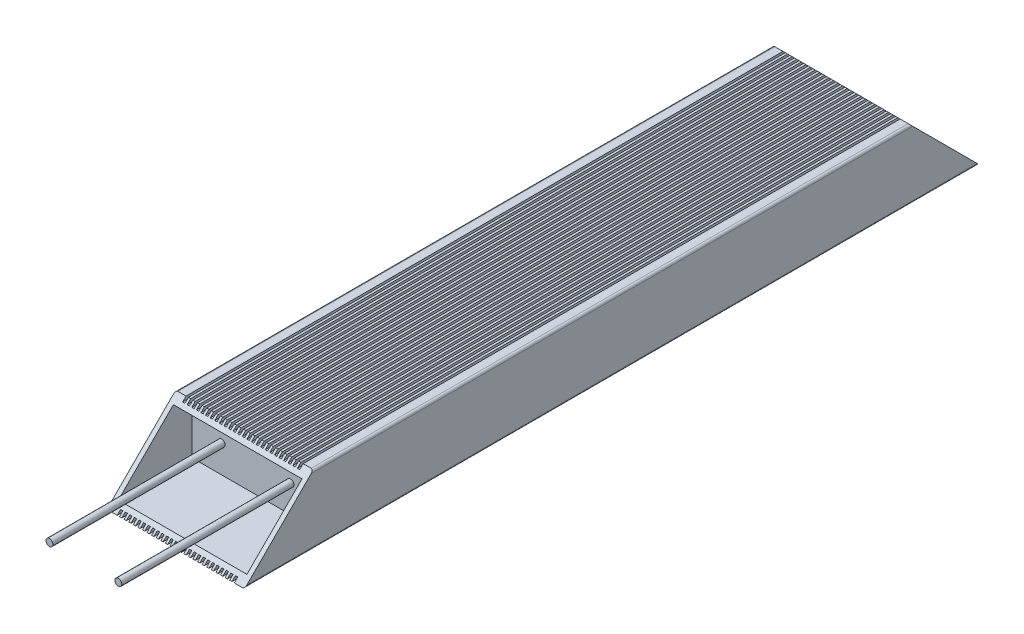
from build123d import *

# Parameters (mm, degrees)
BOSS_EXTRUDE1_DEPTH      = 160
BOSS_EXTRUDE1_DEPTH_BACK = 160
SKETCH1_W                = 56
SKETCH1_H                = 24
CUT_EXTRUDE1_DEPTH       = 172.537167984
CUT_EXTRUDE1_DEPTH_BACK  = 172.537167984
SKETCH1_3_W              = 56
SKETCH1_3_H              = 24
BOSS_EXTRUDE2_DEPTH      = 125
FILLET1_R                = 1
SKETCH4_R                = 1.5
BOSS_EXTRUDE3_DEPTH      = 75


with BuildPart() as part:
    # Sketch1 → Boss-Extrude1 (new, two sides: drawn at the far end of the back side and taken through both)
    with BuildSketch(Plane.XY.offset(-BOSS_EXTRUDE1_DEPTH_BACK)):
        Polygon((-30, 15), (-30, -15), (-25.5, -15), (-25.5, -13.5), (-24.5, -13.5), (-24.5, -15), (-23.5, -15), (-23.5, -13.5), (-22.5, -13.5), (-22.5, -15), (-21.5, -15), (-21.5, -13.5), (-20.5, -13.5), (-20.5, -15), (-19.5, -15), (-19.5, -13.5), (-18.5, -13.5), (-18.5, -15), (-17.5, -15), (-17.5, -13.5), (-16.5, -13.5), (-16.5, -15), (-15.5, -15), (-15.5, -13.5), (-14.5, -13.5), (-14.5, -15), (-13.5, -15), (-13.5, -13.5), (-12.5, -13.5), (-12.5, -15), (-11.5, -15), (-11.5, -13.5), (-10.5, -13.5), (-10.5, -15), (-9.5, -15), (-9.5, -13.5), (-8.5, -13.5), (-8.5, -15), (-7.5, -15), (-7.5, -13.5), (-6.5, -13.5), (-6.5, -15), (-5.5, -15), (-5.5, -13.5), (-4.5, -13.5), (-4.5, -15), (-3.5, -15), (-3.5, -13.5), (-2.5, -13.5), (-2.5, -15), (-1.5, -15), (-1.5, -13.5), (-0.5, -13.5), (-0.5, -15), (0.5, -15), (0.5, -13.5), (1.5, -13.5), (1.5, -15), (2.5, -15), (2.5, -13.5), (3.5, -13.5), (3.5, -15), (4.5, -15), (4.5, -13.5), (5.5, -13.5), (5.5, -15), (6.5, -15), (6.5, -13.5), (7.5, -13.5), (7.5, -15), (8.5, -15), (8.5, -13.5), (9.5, -13.5), (9.5, -15), (10.5, -15), (10.5, -13.5), (11.5, -13.5), (11.5, -15), (12.5, -15), (12.5, -13.5), (13.5, -13.5), (13.5, -15), (14.5, -15), (14.5, -13.5), (15.5, -13.5), (15.5, -15), (16.5, -15), (16.5, -13.5), (17.5, -13.5), (17.5, -15), (18.5, -15), (18.5, -13.5), (19.5, -13.5), (19.5, -15), (20.5, -15), (20.5, -13.5), (21.5, -13.5), (21.5, -15), (22.5, -15), (22.5, -13.5), (23.5, -13.5), (23.5, -15), (24.5, -15), (24.5, -13.5), (25.5, -13.5), (25.5, -15), (30, -15), (30, 15), (25.5, 15), (25.5, 13.5), (24.5, 13.5), (24.5, 15), (23.5, 15), (23.5, 13.5), (22.5, 13.5), (22.5, 15), (21.5, 15), (21.5, 13.5), (20.5, 13.5), (20.5, 15), (19.5, 15), (19.5, 13.5), (18.5, 13.5), (18.5, 15), (17.5, 15), (17.5, 13.5), (16.5, 13.5), (16.5, 15), (15.5, 15), (15.5, 13.5), (14.5, 13.5), (14.5, 15), (13.5, 15), (13.5, 13.5), (12.5, 13.5), (12.5, 15), (11.5, 15), (11.5, 13.5), (10.5, 13.5), (10.5, 15), (9.5, 15), (9.5, 13.5), (8.5, 13.5), (8.5, 15), (7.5, 15), (7.5, 13.5), (6.5, 13.5), (6.5, 15), (5.5, 15), (5.5, 13.5), (4.5, 13.5), (4.5, 15), (3.5, 15), (3.5, 13.5), (2.5, 13.5), (2.5, 15), (1.5, 15), (1.5, 13.5), (0.5, 13.5), (0.5, 15), (-0.5, 15), (-0.5, 13.5), (-1.5, 13.5), (-1.5, 15), (-2.5, 15), (-2.5, 13.5), (-3.5, 13.5), (-3.5, 15), (-4.5, 15), (-4.5, 13.5), (-5.5, 13.5), (-5.5, 15), (-6.5, 15), (-6.5, 13.5), (-7.5, 13.5), (-7.5, 15), (-8.5, 15), (-8.5, 13.5), (-9.5, 13.5), (-9.5, 15), (-10.5, 15), (-10.5, 13.5), (-11.5, 13.5), (-11.5, 15), (-12.5, 15), (-12.5, 13.5), (-13.5, 13.5), (-13.5, 15), (-14.5, 15), (-14.5, 13.5), (-15.5, 13.5), (-15.5, 15), (-16.5, 15), (-16.5, 13.5), (-17.5, 13.5), (-17.5, 15), (-18.5, 15), (-18.5, 13.5), (-19.5, 13.5), (-19.5, 15), (-20.5, 15), (-20.5, 13.5), (-21.5, 13.5), (-21.5, 15), (-22.5, 15), (-22.5, 13.5), (-23.5, 13.5), (-23.5, 15), (-24.5, 15), (-24.5, 13.5), (-25.5, 13.5), (-25.5, 15), align=None)
        Rectangle(SKETCH1_W, SKETCH1_H, mode=Mode.SUBTRACT)
    extrude(amount=BOSS_EXTRUDE1_DEPTH + BOSS_EXTRUDE1_DEPTH_BACK)

    # Sketch3 → Cut-Extrude1 (cut, two sides: drawn at the far end of the back side and taken through both)
    with BuildSketch(Plane(origin=(30, 0, 0), x_dir=(0, 0, -1), z_dir=(1, 0, 0)).offset(-CUT_EXTRUDE1_DEPTH_BACK)):
        Polygon((-160, -15), (-130, 15), (-160, 15), align=None)
        Polygon((160, 15), (160, -15), (130, 15), align=None)
    extrude(amount=CUT_EXTRUDE1_DEPTH + CUT_EXTRUDE1_DEPTH_BACK, mode=Mode.SUBTRACT)

    # Sketch1_3 → Boss-Extrude2 (add, symmetric)
    with BuildSketch(Plane.XY):
        Rectangle(SKETCH1_3_W, SKETCH1_3_H)
    extrude(amount=BOSS_EXTRUDE2_DEPTH, both=True)

    # Fillet1
    fillet1_edges = [part.edges().sort_by_distance(p)[0] for p in [
        (30, 15, 0),
        (-30, 15, 0),
        (30, -15, 0),
        (-30, -15, 0),
    ]]
    fillet(fillet1_edges, radius=FILLET1_R)

    # Sketch4 → Boss-Extrude3 (add)
    with BuildSketch(Plane.XY.offset(125)):
        with Locations((-15, 0)):
            Circle(SKETCH4_R)
        with Locations((15, 0)):
            Circle(SKETCH4_R)
    extrude(amount=BOSS_EXTRUDE3_DEPTH)


solid = part.part
